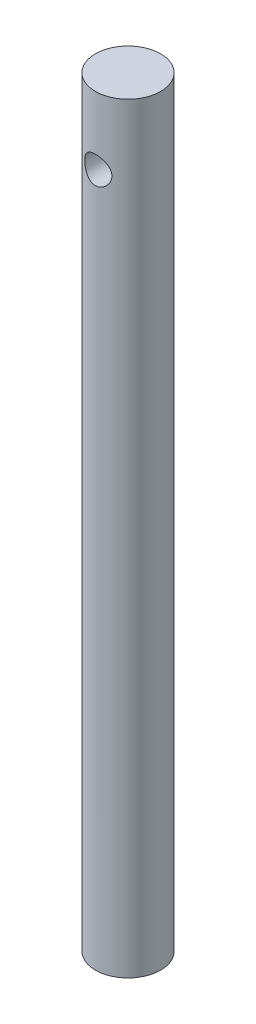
ISO-10303-21;
HEADER;
FILE_DESCRIPTION(('STEP AP214'),'2;1');
FILE_NAME('part.step','',(''),(''),'','','');
FILE_SCHEMA(('AUTOMOTIVE_DESIGN { 1 0 10303 214 1 1 1 1 }'));
ENDSEC;
DATA;
#1=APPLICATION_CONTEXT('core data for automotive mechanical design processes');
#2=APPLICATION_PROTOCOL_DEFINITION('international standard','automotive_design',2000,#1);
#3=PRODUCT_CONTEXT('',#1,'mechanical');
#4=PRODUCT('Part','Part','',(#3));
#5=PRODUCT_RELATED_PRODUCT_CATEGORY('part','',(#4));
#6=PRODUCT_DEFINITION_FORMATION('','',#4);
#7=PRODUCT_DEFINITION_CONTEXT('part definition',#1,'design');
#8=PRODUCT_DEFINITION('design','',#6,#7);
#9=PRODUCT_DEFINITION_SHAPE('','',#8);
#10=(LENGTH_UNIT() NAMED_UNIT(*) SI_UNIT(.MILLI.,.METRE.));
#11=(NAMED_UNIT(*) PLANE_ANGLE_UNIT() SI_UNIT($,.RADIAN.));
#12=(NAMED_UNIT(*) SI_UNIT($,.STERADIAN.) SOLID_ANGLE_UNIT());
#13=UNCERTAINTY_MEASURE_WITH_UNIT(LENGTH_MEASURE(1.E-05),#10,'distance_accuracy_value','');
#14=(GEOMETRIC_REPRESENTATION_CONTEXT(3) GLOBAL_UNCERTAINTY_ASSIGNED_CONTEXT((#13)) GLOBAL_UNIT_ASSIGNED_CONTEXT((#10,
#11,#12)) REPRESENTATION_CONTEXT('',''));
#15=CARTESIAN_POINT('',(0.,0.,0.));
#16=DIRECTION('',(0.,0.,1.));
#17=DIRECTION('',(1.,0.,0.));
#18=AXIS2_PLACEMENT_3D('',#15,#16,#17);
#19=CARTESIAN_POINT('',(-6.,0.,0.));
#20=DIRECTION('',(0.,1.,0.));
#21=DIRECTION('',(0.,0.,1.));
#22=AXIS2_PLACEMENT_3D('',#19,#20,#21);
#23=PLANE('',#22);
#24=CARTESIAN_POINT('',(0.,0.,0.));
#25=DIRECTION('',(0.,-1.,0.));
#26=DIRECTION('',(0.,0.,-1.));
#27=AXIS2_PLACEMENT_3D('',#24,#25,#26);
#28=CIRCLE('',#27,6.);
#29=CARTESIAN_POINT('',(0.,0.,-6.));
#30=VERTEX_POINT('',#29);
#31=EDGE_CURVE('E62',#30,#30,#28,.T.);
#32=ORIENTED_EDGE('',*,*,#31,.T.);
#33=EDGE_LOOP('',(#32));
#34=FACE_BOUND('',#33,.T.);
#35=ADVANCED_FACE('F43',(#34),#23,.F.);
#36=CARTESIAN_POINT('',(0.,140.,0.));
#37=DIRECTION('',(0.,-1.,0.));
#38=DIRECTION('',(0.,0.,-1.));
#39=AXIS2_PLACEMENT_3D('',#36,#37,#38);
#40=PLANE('',#39);
#41=CARTESIAN_POINT('',(0.,140.,0.));
#42=DIRECTION('',(0.,-1.,0.));
#43=DIRECTION('',(0.,0.,-1.));
#44=AXIS2_PLACEMENT_3D('',#41,#42,#43);
#45=CIRCLE('',#44,6.00000000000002);
#46=CARTESIAN_POINT('',(0.,140.,-6.00000000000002));
#47=VERTEX_POINT('',#46);
#48=EDGE_CURVE('E58',#47,#47,#45,.T.);
#49=ORIENTED_EDGE('',*,*,#48,.F.);
#50=EDGE_LOOP('',(#49));
#51=FACE_BOUND('',#50,.T.);
#52=ADVANCED_FACE('F78',(#51),#40,.F.);
#53=CARTESIAN_POINT('',(0.,0.,0.));
#54=DIRECTION('',(0.,-1.,0.));
#55=DIRECTION('',(0.,0.,-1.));
#56=AXIS2_PLACEMENT_3D('',#53,#54,#55);
#57=CYLINDRICAL_SURFACE('',#56,6.00000000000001);
#58=CARTESIAN_POINT('',(0.,130.,-6.00000000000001));
#59=CARTESIAN_POINT('',(-0.133903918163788,129.99999528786,-5.99999628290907));
#60=CARTESIAN_POINT('',(-0.268039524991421,129.989178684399,-5.99546656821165));
#61=CARTESIAN_POINT('',(-0.532498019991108,129.946319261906,-5.97780115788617));
#62=CARTESIAN_POINT('',(-0.662810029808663,129.914221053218,-5.96464300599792));
#63=CARTESIAN_POINT('',(-0.915376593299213,129.830178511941,-5.93112629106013));
#64=CARTESIAN_POINT('',(-1.03765681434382,129.778301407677,-5.9107921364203));
#65=CARTESIAN_POINT('',(-1.27165974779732,129.656454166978,-5.86490559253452));
#66=CARTESIAN_POINT('',(-1.38338564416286,129.586489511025,-5.83935478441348));
#67=CARTESIAN_POINT('',(-1.59889674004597,129.426742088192,-5.78415660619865));
#68=CARTESIAN_POINT('',(-1.70208251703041,129.336197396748,-5.75437507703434));
#69=CARTESIAN_POINT('',(-1.89231966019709,129.1394713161,-5.6946542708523));
#70=CARTESIAN_POINT('',(-1.97936253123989,129.033281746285,-5.6647149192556));
#71=CARTESIAN_POINT('',(-2.13907474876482,128.801946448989,-5.60642043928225));
#72=CARTESIAN_POINT('',(-2.21082616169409,128.676125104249,-5.578215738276));
#73=CARTESIAN_POINT('',(-2.33187881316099,128.412853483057,-5.52871144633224));
#74=CARTESIAN_POINT('',(-2.38119161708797,128.275409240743,-5.50740829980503));
#75=CARTESIAN_POINT('',(-2.45349196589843,127.999692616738,-5.47557110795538));
#76=CARTESIAN_POINT('',(-2.47763315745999,127.861779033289,-5.46456775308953));
#77=CARTESIAN_POINT('',(-2.50250419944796,127.583453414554,-5.45322652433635));
#78=CARTESIAN_POINT('',(-2.50324696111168,127.44304279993,-5.45288276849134));
#79=CARTESIAN_POINT('',(-2.48216900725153,127.175199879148,-5.46250239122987));
#80=CARTESIAN_POINT('',(-2.46207362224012,127.047597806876,-5.47167765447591));
#81=CARTESIAN_POINT('',(-2.40278382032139,126.797775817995,-5.49796965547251));
#82=CARTESIAN_POINT('',(-2.36358574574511,126.675556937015,-5.51508791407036));
#83=CARTESIAN_POINT('',(-2.26643917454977,126.436884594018,-5.5557236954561));
#84=CARTESIAN_POINT('',(-2.20810943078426,126.320609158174,-5.579369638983));
#85=CARTESIAN_POINT('',(-2.07462485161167,126.099044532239,-5.63036662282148));
#86=CARTESIAN_POINT('',(-1.9994633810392,125.993759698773,-5.65771912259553));
#87=CARTESIAN_POINT('',(-1.82699193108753,125.787800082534,-5.71585953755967));
#88=CARTESIAN_POINT('',(-1.728346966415,125.688266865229,-5.74674242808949));
#89=CARTESIAN_POINT('',(-1.51545918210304,125.506772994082,-5.80651346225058));
#90=CARTESIAN_POINT('',(-1.40121271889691,125.424816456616,-5.83540113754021));
#91=CARTESIAN_POINT('',(-1.15689589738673,125.279128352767,-5.88876567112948));
#92=CARTESIAN_POINT('',(-1.02652116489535,125.215861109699,-5.91312533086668));
#93=CARTESIAN_POINT('',(-0.75570480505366,125.112557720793,-5.95378962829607));
#94=CARTESIAN_POINT('',(-0.61526878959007,125.072508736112,-5.97009871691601));
#95=CARTESIAN_POINT('',(-0.33785622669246,125.019168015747,-5.9919928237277));
#96=CARTESIAN_POINT('',(-0.201222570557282,125.004344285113,-5.99819082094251));
#97=CARTESIAN_POINT('',(0.072709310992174,124.997307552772,-6.0011210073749));
#98=CARTESIAN_POINT('',(0.210007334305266,125.005088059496,-5.99785591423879));
#99=CARTESIAN_POINT('',(0.474196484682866,125.041942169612,-5.98262435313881));
#100=CARTESIAN_POINT('',(0.60126593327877,125.069939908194,-5.9710977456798));
#101=CARTESIAN_POINT('',(0.848765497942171,125.144936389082,-5.9409721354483));
#102=CARTESIAN_POINT('',(0.969194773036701,125.191937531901,-5.92237223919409));
#103=CARTESIAN_POINT('',(1.20421799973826,125.305141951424,-5.87916541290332));
#104=CARTESIAN_POINT('',(1.31851447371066,125.371896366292,-5.85438982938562));
#105=CARTESIAN_POINT('',(1.5346924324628,125.522106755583,-5.80147609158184));
#106=CARTESIAN_POINT('',(1.63656870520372,125.605569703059,-5.77333653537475));
#107=CARTESIAN_POINT('',(1.83266686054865,125.793806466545,-5.71424175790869));
#108=CARTESIAN_POINT('',(1.92582139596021,125.899677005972,-5.6832290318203));
#109=CARTESIAN_POINT('',(2.09333969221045,126.126042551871,-5.62368673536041));
#110=CARTESIAN_POINT('',(2.16769918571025,126.246540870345,-5.59515772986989));
#111=CARTESIAN_POINT('',(2.29631920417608,126.501228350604,-5.54362772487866));
#112=CARTESIAN_POINT('',(2.35027836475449,126.635588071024,-5.52071125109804));
#113=CARTESIAN_POINT('',(2.43434827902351,126.912741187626,-5.48416711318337));
#114=CARTESIAN_POINT('',(2.46447869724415,127.055527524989,-5.47053179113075));
#115=CARTESIAN_POINT('',(2.4980816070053,127.333637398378,-5.45526329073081));
#116=CARTESIAN_POINT('',(2.50342760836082,127.468689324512,-5.45278701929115));
#117=CARTESIAN_POINT('',(2.49231151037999,127.737685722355,-5.4578770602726));
#118=CARTESIAN_POINT('',(2.47585275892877,127.8716303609,-5.46544183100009));
#119=CARTESIAN_POINT('',(2.42316809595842,128.128185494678,-5.48899102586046));
#120=CARTESIAN_POINT('',(2.38789807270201,128.251033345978,-5.50456709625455));
#121=CARTESIAN_POINT('',(2.29952656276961,128.489096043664,-5.54206362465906));
#122=CARTESIAN_POINT('',(2.24642006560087,128.604308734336,-5.5639858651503));
#123=CARTESIAN_POINT('',(2.12020572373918,128.831391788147,-5.61333908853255));
#124=CARTESIAN_POINT('',(2.04608723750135,128.942644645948,-5.6410220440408));
#125=CARTESIAN_POINT('',(1.88136812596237,129.151720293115,-5.69807379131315));
#126=CARTESIAN_POINT('',(1.79076178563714,129.249538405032,-5.72744316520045));
#127=CARTESIAN_POINT('',(1.58780416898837,129.436297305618,-5.78712781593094));
#128=CARTESIAN_POINT('',(1.47434977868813,129.524072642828,-5.8173561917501));
#129=CARTESIAN_POINT('',(1.23319985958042,129.679399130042,-5.87320303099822));
#130=CARTESIAN_POINT('',(1.10549787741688,129.746941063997,-5.89881939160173));
#131=CARTESIAN_POINT('',(0.841465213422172,129.858418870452,-5.94218308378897));
#132=CARTESIAN_POINT('',(0.705312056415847,129.90272649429,-5.9600534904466));
#133=CARTESIAN_POINT('',(0.426816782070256,129.96741568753,-5.98642234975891));
#134=CARTESIAN_POINT('',(0.284495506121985,129.987872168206,-5.99495014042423));
#135=CARTESIAN_POINT('',(0.118052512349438,129.997323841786,-5.99888566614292));
#136=CARTESIAN_POINT('',(0.0944569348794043,129.998326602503,-5.99930292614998));
#137=CARTESIAN_POINT('',(0.0472433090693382,129.999665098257,-5.99986042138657));
#138=CARTESIAN_POINT('',(0.0236252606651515,130.000000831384,-6.00000065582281));
#139=CARTESIAN_POINT('',(0.,130.,-6.00000000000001));
#140=B_SPLINE_CURVE_WITH_KNOTS('',3,(#58,#59,#60,#61,#62,#63,#64,#65,#66,#67,#68,#69,#70,#71,
#72,#73,#74,#75,#76,#77,#78,#79,#80,#81,#82,#83,#84,#85,#86,#87,#88,#89,#90,#91,#92,#93,#94,#95,
#96,#97,#98,#99,#100,#101,#102,#103,#104,#105,#106,#107,#108,#109,#110,#111,#112,#113,#114,#115,
#116,#117,#118,#119,#120,#121,#122,#123,#124,#125,#126,#127,#128,#129,#130,#131,#132,#133,#134,
#135,#136,#137,#138,#139),.UNSPECIFIED.,.T.,.F.,(4,2,2,2,2,2,2,2,2,2,2,2,2,2,2,2,2,2,2,2,2,2,2,
2,2,2,2,2,2,2,2,2,2,2,2,2,2,2,2,2,4),(0.,0.401613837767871,0.804277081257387,1.20558370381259,
1.60676887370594,2.02635872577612,2.44616876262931,2.88663449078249,3.32687293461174,
3.74590546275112,4.16470676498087,4.5514031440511,4.93817359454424,5.33317426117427,
5.72833091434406,6.15688282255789,6.58553498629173,7.02408110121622,7.46238448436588,
7.87296886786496,8.28343534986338,8.67353179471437,9.06367753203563,9.46594270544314,
9.86837610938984,10.2995697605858,10.7308612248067,11.1682957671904,11.6053689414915,
12.0087975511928,12.4121642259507,12.7967529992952,13.1814498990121,13.5892778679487,
13.9972474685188,14.4349307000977,14.8728129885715,15.3034571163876,15.7327450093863,
15.803603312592,15.8744618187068),.UNSPECIFIED.);
#141=CARTESIAN_POINT('',(0.,130.,-6.00000000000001));
#142=VERTEX_POINT('',#141);
#143=EDGE_CURVE('E10',#142,#142,#140,.T.);
#144=ORIENTED_EDGE('',*,*,#143,.T.);
#145=EDGE_LOOP('',(#144));
#146=FACE_BOUND('',#145,.T.);
#147=CARTESIAN_POINT('',(2.49999999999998,127.5,5.45435605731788));
#148=CARTESIAN_POINT('',(2.49999850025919,127.433291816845,5.45435734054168));
#149=CARTESIAN_POINT('',(2.49732449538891,127.366565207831,5.45558543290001));
#150=CARTESIAN_POINT('',(2.48666416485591,127.233613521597,5.46045125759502));
#151=CARTESIAN_POINT('',(2.47867468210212,127.167388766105,5.46409042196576));
#152=CARTESIAN_POINT('',(2.4467926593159,126.969948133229,5.478484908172));
#153=CARTESIAN_POINT('',(2.41498683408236,126.840163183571,5.49271671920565));
#154=CARTESIAN_POINT('',(2.33180001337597,126.588845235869,5.52853615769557));
#155=CARTESIAN_POINT('',(2.28049881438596,126.467280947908,5.55009376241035));
#156=CARTESIAN_POINT('',(2.16001268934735,126.234489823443,5.59808356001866));
#157=CARTESIAN_POINT('',(2.09083199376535,126.123260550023,5.62451459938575));
#158=CARTESIAN_POINT('',(1.93194778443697,125.907346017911,5.68111508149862));
#159=CARTESIAN_POINT('',(1.84130648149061,125.803384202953,5.71141131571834));
#160=CARTESIAN_POINT('',(1.64404334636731,125.611600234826,5.77128595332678));
#161=CARTESIAN_POINT('',(1.53741538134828,125.523784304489,5.80086407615));
#162=CARTESIAN_POINT('',(1.30552678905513,125.363100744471,5.85751074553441));
#163=CARTESIAN_POINT('',(1.17965858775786,125.291046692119,5.88441479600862));
#164=CARTESIAN_POINT('',(0.916264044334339,125.169448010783,5.93113040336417));
#165=CARTESIAN_POINT('',(0.778742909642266,125.119893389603,5.95094510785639));
#166=CARTESIAN_POINT('',(0.503536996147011,125.04732106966,5.98035041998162));
#167=CARTESIAN_POINT('',(0.366233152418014,125.023056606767,5.99041942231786));
#168=CARTESIAN_POINT('',(0.0891583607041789,124.997724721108,6.00093657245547));
#169=CARTESIAN_POINT('',(-0.0506115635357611,124.996647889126,6.00138862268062));
#170=CARTESIAN_POINT('',(-0.319585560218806,125.017068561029,5.9929025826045));
#171=CARTESIAN_POINT('',(-0.448914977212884,125.037196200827,5.98453429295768));
#172=CARTESIAN_POINT('',(-0.702165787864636,125.097106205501,5.96013033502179));
#173=CARTESIAN_POINT('',(-0.826086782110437,125.136890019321,5.94409410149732));
#174=CARTESIAN_POINT('',(-1.06727623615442,125.235456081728,5.90559704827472));
#175=CARTESIAN_POINT('',(-1.18441435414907,125.294518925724,5.88304194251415));
#176=CARTESIAN_POINT('',(-1.40742353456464,125.429691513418,5.83371427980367));
#177=CARTESIAN_POINT('',(-1.51329059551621,125.505807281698,5.80694023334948));
#178=CARTESIAN_POINT('',(-1.71868182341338,125.679164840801,5.74963397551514));
#179=CARTESIAN_POINT('',(-1.81723287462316,125.777517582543,5.71896988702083));
#180=CARTESIAN_POINT('',(-1.99686282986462,125.989422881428,5.65875721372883));
#181=CARTESIAN_POINT('',(-2.07793499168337,126.102981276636,5.62920906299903));
#182=CARTESIAN_POINT('',(-2.22280378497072,126.34679007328,5.5736322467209));
#183=CARTESIAN_POINT('',(-2.28594506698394,126.477466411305,5.54775116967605));
#184=CARTESIAN_POINT('',(-2.38892864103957,126.748962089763,5.5041968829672));
#185=CARTESIAN_POINT('',(-2.42878759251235,126.889774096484,5.48651780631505));
#186=CARTESIAN_POINT('',(-2.48160050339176,127.167793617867,5.46282425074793));
#187=CARTESIAN_POINT('',(-2.49613229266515,127.304642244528,5.45612738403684));
#188=CARTESIAN_POINT('',(-2.50251261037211,127.578956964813,5.45320573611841));
#189=CARTESIAN_POINT('',(-2.49436898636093,127.716422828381,5.45697733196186));
#190=CARTESIAN_POINT('',(-2.45706955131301,127.978796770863,5.47386262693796));
#191=CARTESIAN_POINT('',(-2.42929237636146,128.103945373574,5.48636276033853));
#192=CARTESIAN_POINT('',(-2.35534117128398,128.347702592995,5.51851260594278));
#193=CARTESIAN_POINT('',(-2.30916284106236,128.466309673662,5.53816398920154));
#194=CARTESIAN_POINT('',(-2.19755041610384,128.699230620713,5.58341595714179));
#195=CARTESIAN_POINT('',(-2.1313836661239,128.813149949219,5.60923324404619));
#196=CARTESIAN_POINT('',(-1.98240156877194,129.028816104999,5.66360007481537));
#197=CARTESIAN_POINT('',(-1.8995790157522,129.130557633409,5.69215079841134));
#198=CARTESIAN_POINT('',(-1.71168891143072,129.327600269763,5.75157239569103));
#199=CARTESIAN_POINT('',(-1.60535932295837,129.42170279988,5.78244293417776));
#200=CARTESIAN_POINT('',(-1.37770302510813,129.59094458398,5.84086722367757));
#201=CARTESIAN_POINT('',(-1.25637521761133,129.666082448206,5.86842073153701));
#202=CARTESIAN_POINT('',(-1.00130936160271,129.795179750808,5.91728503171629));
#203=CARTESIAN_POINT('',(-0.867540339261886,129.849084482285,5.93857966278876));
#204=CARTESIAN_POINT('',(-0.591717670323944,129.933233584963,5.97236346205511));
#205=CARTESIAN_POINT('',(-0.449669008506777,129.963492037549,5.98485787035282));
#206=CARTESIAN_POINT('',(-0.172033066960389,129.99771625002,5.99903069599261));
#207=CARTESIAN_POINT('',(-0.0366881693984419,130.00337199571,6.00140409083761));
#208=CARTESIAN_POINT('',(0.232973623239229,129.992773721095,5.996990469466));
#209=CARTESIAN_POINT('',(0.367290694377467,129.976523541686,5.99020505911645));
#210=CARTESIAN_POINT('',(0.626172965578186,129.923787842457,5.9686013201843));
#211=CARTESIAN_POINT('',(0.750915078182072,129.888040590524,5.95407648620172));
#212=CARTESIAN_POINT('',(0.992584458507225,129.798131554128,5.91858999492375));
#213=CARTESIAN_POINT('',(1.10951023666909,129.743966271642,5.89762711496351));
#214=CARTESIAN_POINT('',(1.33804914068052,129.616020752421,5.85011651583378));
#215=CARTESIAN_POINT('',(1.44918335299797,129.541464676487,5.823359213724));
#216=CARTESIAN_POINT('',(1.65783731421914,129.375986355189,5.76743120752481));
#217=CARTESIAN_POINT('',(1.7553519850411,129.285058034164,5.73825960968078));
#218=CARTESIAN_POINT('',(1.94089972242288,129.082107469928,5.67829702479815));
#219=CARTESIAN_POINT('',(2.02783607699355,128.96907088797,5.6475309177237));
#220=CARTESIAN_POINT('',(2.18166607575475,128.729093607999,5.58991059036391));
#221=CARTESIAN_POINT('',(2.24854851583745,128.602145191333,5.56305856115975));
#222=CARTESIAN_POINT('',(2.35965744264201,128.338071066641,5.51685287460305));
#223=CARTESIAN_POINT('',(2.40400437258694,128.20100404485,5.49745949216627));
#224=CARTESIAN_POINT('',(2.45239925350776,127.990836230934,5.47594959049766));
#225=CARTESIAN_POINT('',(2.46550603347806,127.920089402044,5.47004503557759));
#226=CARTESIAN_POINT('',(2.48558130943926,127.777573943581,5.4609537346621));
#227=CARTESIAN_POINT('',(2.49255414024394,127.705806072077,5.45776506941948));
#228=CARTESIAN_POINT('',(2.49880479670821,127.589288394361,5.4549039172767));
#229=CARTESIAN_POINT('',(2.50000100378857,127.544648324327,5.45435519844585));
#230=CARTESIAN_POINT('',(2.49999999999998,127.5,5.45435605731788));
#231=B_SPLINE_CURVE_WITH_KNOTS('',3,(#147,#148,#149,#150,#151,#152,#153,#154,#155,#156,#157,
#158,#159,#160,#161,#162,#163,#164,#165,#166,#167,#168,#169,#170,#171,#172,#173,#174,#175,#176,
#177,#178,#179,#180,#181,#182,#183,#184,#185,#186,#187,#188,#189,#190,#191,#192,#193,#194,#195,
#196,#197,#198,#199,#200,#201,#202,#203,#204,#205,#206,#207,#208,#209,#210,#211,#212,#213,#214,
#215,#216,#217,#218,#219,#220,#221,#222,#223,#224,#225,#226,#227,#228,#229,#230),.UNSPECIFIED.,
.T.,.F.,(4,2,2,2,2,2,2,2,2,2,2,2,2,2,2,2,2,2,2,2,2,2,2,2,2,2,2,2,2,2,2,2,2,2,2,2,2,2,2,2,2,4),
(0.,0.200084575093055,0.400288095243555,0.8012789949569,1.2006459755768,1.59991854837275,
2.0217214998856,2.44368668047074,2.883954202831,3.32402600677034,3.74119679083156,
4.15819828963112,4.54982147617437,4.94147353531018,5.33910096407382,5.73686909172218,
6.16267530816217,6.58864548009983,7.0286155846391,7.46827048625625,7.87940023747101,
8.29038772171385,8.67506269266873,9.05982760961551,9.46088720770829,9.86212068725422,
10.2960179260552,10.7299469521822,11.1649867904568,11.599767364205,12.0041573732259,
12.4084764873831,12.7984529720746,13.1885035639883,13.5961819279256,14.0040118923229,
14.4395932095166,14.8754174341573,15.3088871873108,15.525205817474,15.7413714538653,
15.8752896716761),.UNSPECIFIED.);
#232=CARTESIAN_POINT('',(2.49999999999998,127.5,5.45435605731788));
#233=VERTEX_POINT('',#232);
#234=EDGE_CURVE('E54',#233,#233,#231,.T.);
#235=ORIENTED_EDGE('',*,*,#234,.T.);
#236=EDGE_LOOP('',(#235));
#237=FACE_BOUND('',#236,.T.);
#238=ORIENTED_EDGE('',*,*,#31,.F.);
#239=EDGE_LOOP('',(#238));
#240=FACE_BOUND('',#239,.T.);
#241=ORIENTED_EDGE('',*,*,#48,.T.);
#242=EDGE_LOOP('',(#241));
#243=FACE_BOUND('',#242,.T.);
#244=ADVANCED_FACE('F68',(#146,#237,#240,#243),#57,.T.);
#245=CARTESIAN_POINT('',(0.,127.5,-6.00000000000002));
#246=DIRECTION('',(0.,0.,1.));
#247=DIRECTION('',(1.,0.,0.));
#248=AXIS2_PLACEMENT_3D('',#245,#246,#247);
#249=CYLINDRICAL_SURFACE('',#248,2.49999999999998);
#250=ORIENTED_EDGE('',*,*,#234,.F.);
#251=EDGE_LOOP('',(#250));
#252=FACE_BOUND('',#251,.T.);
#253=ORIENTED_EDGE('',*,*,#143,.F.);
#254=EDGE_LOOP('',(#253));
#255=FACE_BOUND('',#254,.T.);
#256=ADVANCED_FACE('F70',(#252,#255),#249,.F.);
#257=CLOSED_SHELL('',(#35,#52,#244,#256));
#258=MANIFOLD_SOLID_BREP('B2',#257);
#259=ADVANCED_BREP_SHAPE_REPRESENTATION('',(#18,#258),#14);
#260=SHAPE_DEFINITION_REPRESENTATION(#9,#259);
ENDSEC;
END-ISO-10303-21;
